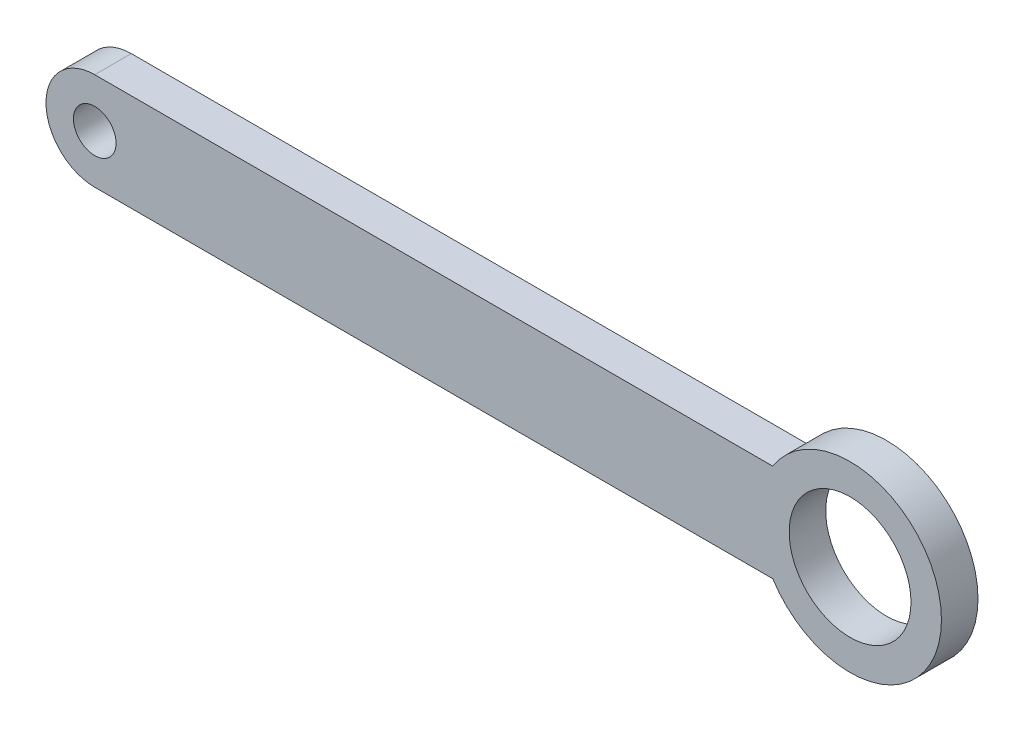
ISO-10303-21;
HEADER;
FILE_DESCRIPTION(('STEP AP214'),'2;1');
FILE_NAME('part.step','',(''),(''),'','','');
FILE_SCHEMA(('AUTOMOTIVE_DESIGN { 1 0 10303 214 1 1 1 1 }'));
ENDSEC;
DATA;
#1=APPLICATION_CONTEXT('core data for automotive mechanical design processes');
#2=APPLICATION_PROTOCOL_DEFINITION('international standard','automotive_design',2000,#1);
#3=PRODUCT_CONTEXT('',#1,'mechanical');
#4=PRODUCT('Part','Part','',(#3));
#5=PRODUCT_RELATED_PRODUCT_CATEGORY('part','',(#4));
#6=PRODUCT_DEFINITION_FORMATION('','',#4);
#7=PRODUCT_DEFINITION_CONTEXT('part definition',#1,'design');
#8=PRODUCT_DEFINITION('design','',#6,#7);
#9=PRODUCT_DEFINITION_SHAPE('','',#8);
#10=(LENGTH_UNIT() NAMED_UNIT(*) SI_UNIT(.MILLI.,.METRE.));
#11=(NAMED_UNIT(*) PLANE_ANGLE_UNIT() SI_UNIT($,.RADIAN.));
#12=(NAMED_UNIT(*) SI_UNIT($,.STERADIAN.) SOLID_ANGLE_UNIT());
#13=UNCERTAINTY_MEASURE_WITH_UNIT(LENGTH_MEASURE(1.E-05),#10,'distance_accuracy_value','');
#14=(GEOMETRIC_REPRESENTATION_CONTEXT(3) GLOBAL_UNCERTAINTY_ASSIGNED_CONTEXT((#13)) GLOBAL_UNIT_ASSIGNED_CONTEXT((#10,
#11,#12)) REPRESENTATION_CONTEXT('',''));
#15=CARTESIAN_POINT('',(0.,0.,0.));
#16=DIRECTION('',(0.,0.,1.));
#17=DIRECTION('',(1.,0.,0.));
#18=AXIS2_PLACEMENT_3D('',#15,#16,#17);
#19=CARTESIAN_POINT('',(0.,4.,3.));
#20=DIRECTION('',(0.,1.,0.));
#21=DIRECTION('',(0.,0.,1.));
#22=AXIS2_PLACEMENT_3D('',#19,#20,#21);
#23=PLANE('',#22);
#24=DIRECTION('',(1.,0.,0.));
#25=VECTOR('',#24,1.);
#26=CARTESIAN_POINT('',(0.,4.,0.));
#27=LINE('',#26,#25);
#28=CARTESIAN_POINT('',(-62.,4.,0.));
#29=VERTEX_POINT('',#28);
#30=CARTESIAN_POINT('',(-6.34428877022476,4.,0.));
#31=VERTEX_POINT('',#30);
#32=EDGE_CURVE('E110',#29,#31,#27,.T.);
#33=ORIENTED_EDGE('',*,*,#32,.F.);
#34=DIRECTION('',(0.,0.,-1.));
#35=VECTOR('',#34,1.);
#36=CARTESIAN_POINT('',(-62.,4.,3.));
#37=LINE('',#36,#35);
#38=CARTESIAN_POINT('',(-62.,4.,3.));
#39=VERTEX_POINT('',#38);
#40=EDGE_CURVE('E11',#39,#29,#37,.T.);
#41=ORIENTED_EDGE('',*,*,#40,.F.);
#42=DIRECTION('',(1.,0.,0.));
#43=VECTOR('',#42,1.);
#44=CARTESIAN_POINT('',(0.,4.,3.));
#45=LINE('',#44,#43);
#46=CARTESIAN_POINT('',(-6.34428877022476,4.,3.));
#47=VERTEX_POINT('',#46);
#48=EDGE_CURVE('E96',#39,#47,#45,.T.);
#49=ORIENTED_EDGE('',*,*,#48,.T.);
#50=DIRECTION('',(0.,0.,-1.));
#51=VECTOR('',#50,1.);
#52=CARTESIAN_POINT('',(-6.34428877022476,4.,3.));
#53=LINE('',#52,#51);
#54=EDGE_CURVE('E78',#47,#31,#53,.T.);
#55=ORIENTED_EDGE('',*,*,#54,.T.);
#56=EDGE_LOOP('',(#33,#41,#49,#55));
#57=FACE_BOUND('',#56,.T.);
#58=ADVANCED_FACE('F39',(#57),#23,.T.);
#59=CARTESIAN_POINT('',(-62.,0.,3.));
#60=DIRECTION('',(0.,0.,-1.));
#61=DIRECTION('',(-1.,0.,0.));
#62=AXIS2_PLACEMENT_3D('',#59,#60,#61);
#63=CYLINDRICAL_SURFACE('',#62,4.00000000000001);
#64=CARTESIAN_POINT('',(-62.,0.,0.));
#65=DIRECTION('',(0.,0.,1.));
#66=DIRECTION('',(1.,0.,0.));
#67=AXIS2_PLACEMENT_3D('',#64,#65,#66);
#68=CIRCLE('',#67,4.00000000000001);
#69=CARTESIAN_POINT('',(-62.,-4.00000000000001,0.));
#70=VERTEX_POINT('',#69);
#71=EDGE_CURVE('E101',#29,#70,#68,.T.);
#72=ORIENTED_EDGE('',*,*,#71,.T.);
#73=DIRECTION('',(0.,0.,-1.));
#74=VECTOR('',#73,1.);
#75=CARTESIAN_POINT('',(-62.,-4.00000000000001,3.));
#76=LINE('',#75,#74);
#77=CARTESIAN_POINT('',(-62.,-4.00000000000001,3.));
#78=VERTEX_POINT('',#77);
#79=EDGE_CURVE('E48',#78,#70,#76,.T.);
#80=ORIENTED_EDGE('',*,*,#79,.F.);
#81=CARTESIAN_POINT('',(-62.,0.,3.));
#82=DIRECTION('',(0.,0.,1.));
#83=DIRECTION('',(1.,0.,0.));
#84=AXIS2_PLACEMENT_3D('',#81,#82,#83);
#85=CIRCLE('',#84,4.00000000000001);
#86=EDGE_CURVE('E93',#39,#78,#85,.T.);
#87=ORIENTED_EDGE('',*,*,#86,.F.);
#88=ORIENTED_EDGE('',*,*,#40,.T.);
#89=EDGE_LOOP('',(#72,#80,#87,#88));
#90=FACE_BOUND('',#89,.T.);
#91=ADVANCED_FACE('F99',(#90),#63,.T.);
#92=CARTESIAN_POINT('',(0.,-4.00000000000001,3.));
#93=DIRECTION('',(0.,1.,0.));
#94=DIRECTION('',(0.,0.,1.));
#95=AXIS2_PLACEMENT_3D('',#92,#93,#94);
#96=PLANE('',#95);
#97=DIRECTION('',(1.,0.,0.));
#98=VECTOR('',#97,1.);
#99=CARTESIAN_POINT('',(0.,-4.00000000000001,0.));
#100=LINE('',#99,#98);
#101=CARTESIAN_POINT('',(-6.34428877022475,-4.00000000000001,0.));
#102=VERTEX_POINT('',#101);
#103=EDGE_CURVE('E107',#70,#102,#100,.T.);
#104=ORIENTED_EDGE('',*,*,#103,.T.);
#105=DIRECTION('',(0.,0.,-1.));
#106=VECTOR('',#105,1.);
#107=CARTESIAN_POINT('',(-6.34428877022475,-4.00000000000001,3.));
#108=LINE('',#107,#106);
#109=CARTESIAN_POINT('',(-6.34428877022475,-4.00000000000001,3.));
#110=VERTEX_POINT('',#109);
#111=EDGE_CURVE('E92',#110,#102,#108,.T.);
#112=ORIENTED_EDGE('',*,*,#111,.F.);
#113=DIRECTION('',(1.,0.,0.));
#114=VECTOR('',#113,1.);
#115=CARTESIAN_POINT('',(0.,-4.00000000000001,3.));
#116=LINE('',#115,#114);
#117=EDGE_CURVE('E86',#78,#110,#116,.T.);
#118=ORIENTED_EDGE('',*,*,#117,.F.);
#119=ORIENTED_EDGE('',*,*,#79,.T.);
#120=EDGE_LOOP('',(#104,#112,#118,#119));
#121=FACE_BOUND('',#120,.T.);
#122=ADVANCED_FACE('F89',(#121),#96,.F.);
#123=CARTESIAN_POINT('',(0.,0.,3.));
#124=DIRECTION('',(0.,0.,-1.));
#125=DIRECTION('',(-1.,0.,0.));
#126=AXIS2_PLACEMENT_3D('',#123,#124,#125);
#127=CYLINDRICAL_SURFACE('',#126,5.);
#128=CARTESIAN_POINT('',(0.,0.,3.));
#129=DIRECTION('',(0.,0.,1.));
#130=DIRECTION('',(1.,0.,0.));
#131=AXIS2_PLACEMENT_3D('',#128,#129,#130);
#132=CIRCLE('',#131,5.);
#133=CARTESIAN_POINT('',(5.,0.,3.));
#134=VERTEX_POINT('',#133);
#135=EDGE_CURVE('E120',#134,#134,#132,.T.);
#136=ORIENTED_EDGE('',*,*,#135,.T.);
#137=EDGE_LOOP('',(#136));
#138=FACE_BOUND('',#137,.T.);
#139=CARTESIAN_POINT('',(0.,0.,0.));
#140=DIRECTION('',(0.,0.,1.));
#141=DIRECTION('',(1.,0.,0.));
#142=AXIS2_PLACEMENT_3D('',#139,#140,#141);
#143=CIRCLE('',#142,5.);
#144=CARTESIAN_POINT('',(5.,0.,0.));
#145=VERTEX_POINT('',#144);
#146=EDGE_CURVE('E112',#145,#145,#143,.T.);
#147=ORIENTED_EDGE('',*,*,#146,.F.);
#148=EDGE_LOOP('',(#147));
#149=FACE_BOUND('',#148,.T.);
#150=ADVANCED_FACE('F135',(#138,#149),#127,.F.);
#151=CARTESIAN_POINT('',(-62.,0.,3.));
#152=DIRECTION('',(0.,0.,-1.));
#153=DIRECTION('',(-1.,0.,0.));
#154=AXIS2_PLACEMENT_3D('',#151,#152,#153);
#155=CYLINDRICAL_SURFACE('',#154,1.75);
#156=CARTESIAN_POINT('',(-62.,0.,3.));
#157=DIRECTION('',(0.,0.,1.));
#158=DIRECTION('',(1.,0.,0.));
#159=AXIS2_PLACEMENT_3D('',#156,#157,#158);
#160=CIRCLE('',#159,1.75);
#161=CARTESIAN_POINT('',(-60.25,0.,3.));
#162=VERTEX_POINT('',#161);
#163=EDGE_CURVE('E106',#162,#162,#160,.T.);
#164=ORIENTED_EDGE('',*,*,#163,.T.);
#165=EDGE_LOOP('',(#164));
#166=FACE_BOUND('',#165,.T.);
#167=CARTESIAN_POINT('',(-62.,0.,0.));
#168=DIRECTION('',(0.,0.,1.));
#169=DIRECTION('',(1.,0.,0.));
#170=AXIS2_PLACEMENT_3D('',#167,#168,#169);
#171=CIRCLE('',#170,1.75);
#172=CARTESIAN_POINT('',(-60.25,0.,0.));
#173=VERTEX_POINT('',#172);
#174=EDGE_CURVE('E115',#173,#173,#171,.T.);
#175=ORIENTED_EDGE('',*,*,#174,.F.);
#176=EDGE_LOOP('',(#175));
#177=FACE_BOUND('',#176,.T.);
#178=ADVANCED_FACE('F41',(#166,#177),#155,.F.);
#179=CARTESIAN_POINT('',(0.,0.,3.));
#180=DIRECTION('',(0.,0.,-1.));
#181=DIRECTION('',(-1.,0.,0.));
#182=AXIS2_PLACEMENT_3D('',#179,#180,#181);
#183=CYLINDRICAL_SURFACE('',#182,7.5);
#184=CARTESIAN_POINT('',(0.,0.,0.));
#185=DIRECTION('',(0.,0.,1.));
#186=DIRECTION('',(1.,0.,0.));
#187=AXIS2_PLACEMENT_3D('',#184,#185,#186);
#188=CIRCLE('',#187,7.5);
#189=EDGE_CURVE('E71',#102,#31,#188,.T.);
#190=ORIENTED_EDGE('',*,*,#189,.T.);
#191=ORIENTED_EDGE('',*,*,#54,.F.);
#192=CARTESIAN_POINT('',(0.,0.,3.));
#193=DIRECTION('',(0.,0.,1.));
#194=DIRECTION('',(1.,0.,0.));
#195=AXIS2_PLACEMENT_3D('',#192,#193,#194);
#196=CIRCLE('',#195,7.5);
#197=EDGE_CURVE('E56',#110,#47,#196,.T.);
#198=ORIENTED_EDGE('',*,*,#197,.F.);
#199=ORIENTED_EDGE('',*,*,#111,.T.);
#200=EDGE_LOOP('',(#190,#191,#198,#199));
#201=FACE_BOUND('',#200,.T.);
#202=ADVANCED_FACE('F131',(#201),#183,.T.);
#203=CARTESIAN_POINT('',(0.,0.,3.));
#204=DIRECTION('',(0.,0.,1.));
#205=DIRECTION('',(1.,0.,0.));
#206=AXIS2_PLACEMENT_3D('',#203,#204,#205);
#207=PLANE('',#206);
#208=ORIENTED_EDGE('',*,*,#163,.F.);
#209=EDGE_LOOP('',(#208));
#210=FACE_BOUND('',#209,.T.);
#211=ORIENTED_EDGE('',*,*,#135,.F.);
#212=EDGE_LOOP('',(#211));
#213=FACE_BOUND('',#212,.T.);
#214=ORIENTED_EDGE('',*,*,#48,.F.);
#215=ORIENTED_EDGE('',*,*,#86,.T.);
#216=ORIENTED_EDGE('',*,*,#117,.T.);
#217=ORIENTED_EDGE('',*,*,#197,.T.);
#218=EDGE_LOOP('',(#214,#215,#216,#217));
#219=FACE_BOUND('',#218,.T.);
#220=ADVANCED_FACE('F95',(#210,#213,#219),#207,.T.);
#221=CARTESIAN_POINT('',(0.,0.,0.));
#222=DIRECTION('',(0.,0.,1.));
#223=DIRECTION('',(1.,0.,0.));
#224=AXIS2_PLACEMENT_3D('',#221,#222,#223);
#225=PLANE('',#224);
#226=ORIENTED_EDGE('',*,*,#174,.T.);
#227=EDGE_LOOP('',(#226));
#228=FACE_BOUND('',#227,.T.);
#229=ORIENTED_EDGE('',*,*,#146,.T.);
#230=EDGE_LOOP('',(#229));
#231=FACE_BOUND('',#230,.T.);
#232=ORIENTED_EDGE('',*,*,#32,.T.);
#233=ORIENTED_EDGE('',*,*,#189,.F.);
#234=ORIENTED_EDGE('',*,*,#103,.F.);
#235=ORIENTED_EDGE('',*,*,#71,.F.);
#236=EDGE_LOOP('',(#232,#233,#234,#235));
#237=FACE_BOUND('',#236,.T.);
#238=ADVANCED_FACE('F130',(#228,#231,#237),#225,.F.);
#239=CLOSED_SHELL('',(#58,#91,#122,#150,#178,#202,#220,#238));
#240=MANIFOLD_SOLID_BREP('B2',#239);
#241=ADVANCED_BREP_SHAPE_REPRESENTATION('',(#18,#240),#14);
#242=SHAPE_DEFINITION_REPRESENTATION(#9,#241);
ENDSEC;
END-ISO-10303-21;
